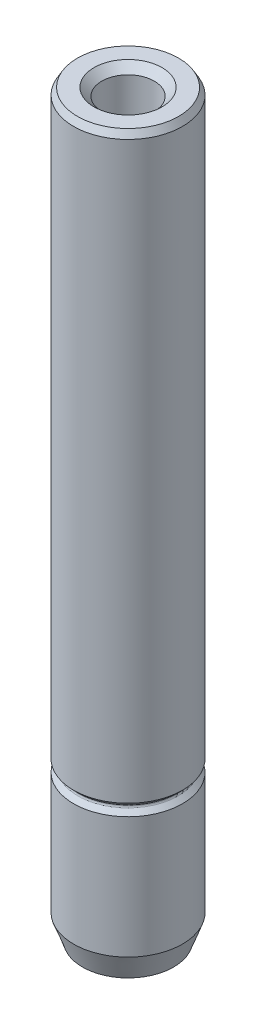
ISO-10303-21;
HEADER;
FILE_DESCRIPTION(('STEP AP214'),'2;1');
FILE_NAME('part.step','',(''),(''),'','','');
FILE_SCHEMA(('AUTOMOTIVE_DESIGN { 1 0 10303 214 1 1 1 1 }'));
ENDSEC;
DATA;
#1=APPLICATION_CONTEXT('core data for automotive mechanical design processes');
#2=APPLICATION_PROTOCOL_DEFINITION('international standard','automotive_design',2000,#1);
#3=PRODUCT_CONTEXT('',#1,'mechanical');
#4=PRODUCT('Part','Part','',(#3));
#5=PRODUCT_RELATED_PRODUCT_CATEGORY('part','',(#4));
#6=PRODUCT_DEFINITION_FORMATION('','',#4);
#7=PRODUCT_DEFINITION_CONTEXT('part definition',#1,'design');
#8=PRODUCT_DEFINITION('design','',#6,#7);
#9=PRODUCT_DEFINITION_SHAPE('','',#8);
#10=(LENGTH_UNIT() NAMED_UNIT(*) SI_UNIT(.MILLI.,.METRE.));
#11=(NAMED_UNIT(*) PLANE_ANGLE_UNIT() SI_UNIT($,.RADIAN.));
#12=(NAMED_UNIT(*) SI_UNIT($,.STERADIAN.) SOLID_ANGLE_UNIT());
#13=UNCERTAINTY_MEASURE_WITH_UNIT(LENGTH_MEASURE(1.E-05),#10,'distance_accuracy_value','');
#14=(GEOMETRIC_REPRESENTATION_CONTEXT(3) GLOBAL_UNCERTAINTY_ASSIGNED_CONTEXT((#13)) GLOBAL_UNIT_ASSIGNED_CONTEXT((#10,
#11,#12)) REPRESENTATION_CONTEXT('',''));
#15=CARTESIAN_POINT('',(0.,0.,0.));
#16=DIRECTION('',(0.,0.,1.));
#17=DIRECTION('',(1.,0.,0.));
#18=AXIS2_PLACEMENT_3D('',#15,#16,#17);
#19=CARTESIAN_POINT('',(-2.9781972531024,0.,0.));
#20=DIRECTION('',(0.,1.,0.));
#21=DIRECTION('',(0.,0.,1.));
#22=AXIS2_PLACEMENT_3D('',#19,#20,#21);
#23=PLANE('',#22);
#24=CARTESIAN_POINT('',(0.,0.,0.));
#25=DIRECTION('',(0.,-1.,0.));
#26=DIRECTION('',(0.,0.,-1.));
#27=AXIS2_PLACEMENT_3D('',#24,#25,#26);
#28=CIRCLE('',#27,2.159);
#29=CARTESIAN_POINT('',(0.,0.,-2.159));
#30=VERTEX_POINT('',#29);
#31=EDGE_CURVE('E66',#30,#30,#28,.T.);
#32=ORIENTED_EDGE('',*,*,#31,.F.);
#33=EDGE_LOOP('',(#32));
#34=FACE_BOUND('',#33,.T.);
#35=CARTESIAN_POINT('',(0.,0.,0.));
#36=DIRECTION('',(0.,-1.,0.));
#37=DIRECTION('',(0.,0.,-1.));
#38=AXIS2_PLACEMENT_3D('',#35,#36,#37);
#39=CIRCLE('',#38,2.9781972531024);
#40=CARTESIAN_POINT('',(0.,0.,-2.9781972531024));
#41=VERTEX_POINT('',#40);
#42=EDGE_CURVE('E84',#41,#41,#39,.T.);
#43=ORIENTED_EDGE('',*,*,#42,.T.);
#44=EDGE_LOOP('',(#43));
#45=FACE_BOUND('',#44,.T.);
#46=ADVANCED_FACE('F36',(#34,#45),#23,.F.);
#47=CARTESIAN_POINT('',(0.,0.,0.));
#48=DIRECTION('',(0.,-1.,0.));
#49=DIRECTION('',(0.,0.,-1.));
#50=AXIS2_PLACEMENT_3D('',#47,#48,#49);
#51=CYLINDRICAL_SURFACE('',#50,2.159);
#52=CARTESIAN_POINT('',(0.,1.6002,0.));
#53=DIRECTION('',(0.,-1.,0.));
#54=DIRECTION('',(0.,0.,-1.));
#55=AXIS2_PLACEMENT_3D('',#52,#53,#54);
#56=CIRCLE('',#55,2.159);
#57=CARTESIAN_POINT('',(0.,1.6002,-2.159));
#58=VERTEX_POINT('',#57);
#59=EDGE_CURVE('E69',#58,#58,#56,.T.);
#60=ORIENTED_EDGE('',*,*,#59,.F.);
#61=EDGE_LOOP('',(#60));
#62=FACE_BOUND('',#61,.T.);
#63=ORIENTED_EDGE('',*,*,#31,.T.);
#64=EDGE_LOOP('',(#63));
#65=FACE_BOUND('',#64,.T.);
#66=ADVANCED_FACE('F112',(#62,#65),#51,.F.);
#67=CARTESIAN_POINT('',(-2.159,1.6002,0.));
#68=DIRECTION('',(0.,1.,0.));
#69=DIRECTION('',(0.,0.,1.));
#70=AXIS2_PLACEMENT_3D('',#67,#68,#69);
#71=PLANE('',#70);
#72=CARTESIAN_POINT('',(0.,1.6002,0.));
#73=DIRECTION('',(0.,-1.,0.));
#74=DIRECTION('',(0.,0.,-1.));
#75=AXIS2_PLACEMENT_3D('',#72,#73,#74);
#76=CIRCLE('',#75,1.7145);
#77=CARTESIAN_POINT('',(0.,1.6002,-1.7145));
#78=VERTEX_POINT('',#77);
#79=EDGE_CURVE('E72',#78,#78,#76,.T.);
#80=ORIENTED_EDGE('',*,*,#79,.F.);
#81=EDGE_LOOP('',(#80));
#82=FACE_BOUND('',#81,.T.);
#83=ORIENTED_EDGE('',*,*,#59,.T.);
#84=EDGE_LOOP('',(#83));
#85=FACE_BOUND('',#84,.T.);
#86=ADVANCED_FACE('F118',(#82,#85),#71,.F.);
#87=CARTESIAN_POINT('',(0.,0.,0.));
#88=DIRECTION('',(0.,-1.,0.));
#89=DIRECTION('',(0.,0.,-1.));
#90=AXIS2_PLACEMENT_3D('',#87,#88,#89);
#91=CYLINDRICAL_SURFACE('',#90,1.7145);
#92=CARTESIAN_POINT('',(0.,47.752,0.));
#93=DIRECTION('',(0.,-1.,0.));
#94=DIRECTION('',(0.,0.,-1.));
#95=AXIS2_PLACEMENT_3D('',#92,#93,#94);
#96=CIRCLE('',#95,1.7145);
#97=CARTESIAN_POINT('',(0.,47.752,-1.7145));
#98=VERTEX_POINT('',#97);
#99=EDGE_CURVE('E47',#98,#98,#96,.F.);
#100=ORIENTED_EDGE('',*,*,#99,.T.);
#101=EDGE_LOOP('',(#100));
#102=FACE_BOUND('',#101,.T.);
#103=ORIENTED_EDGE('',*,*,#79,.T.);
#104=EDGE_LOOP('',(#103));
#105=FACE_BOUND('',#104,.T.);
#106=ADVANCED_FACE('F140',(#102,#105),#91,.F.);
#107=CARTESIAN_POINT('',(-1.7145,48.26,0.));
#108=DIRECTION('',(0.,-1.,0.));
#109=DIRECTION('',(0.,0.,-1.));
#110=AXIS2_PLACEMENT_3D('',#107,#108,#109);
#111=PLANE('',#110);
#112=CARTESIAN_POINT('',(0.,48.26,0.));
#113=DIRECTION('',(0.,-1.,0.));
#114=DIRECTION('',(0.,0.,-1.));
#115=AXIS2_PLACEMENT_3D('',#112,#113,#114);
#116=CIRCLE('',#115,2.2225);
#117=CARTESIAN_POINT('',(0.,48.26,-2.2225));
#118=VERTEX_POINT('',#117);
#119=EDGE_CURVE('E52',#118,#118,#116,.T.);
#120=ORIENTED_EDGE('',*,*,#119,.T.);
#121=EDGE_LOOP('',(#120));
#122=FACE_BOUND('',#121,.T.);
#123=CARTESIAN_POINT('',(0.,48.26,0.));
#124=DIRECTION('',(0.,-1.,0.));
#125=DIRECTION('',(0.,0.,-1.));
#126=AXIS2_PLACEMENT_3D('',#123,#124,#125);
#127=CIRCLE('',#126,3.30200000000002);
#128=CARTESIAN_POINT('',(0.,48.26,-3.30200000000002));
#129=VERTEX_POINT('',#128);
#130=EDGE_CURVE('E58',#129,#129,#127,.F.);
#131=ORIENTED_EDGE('',*,*,#130,.T.);
#132=EDGE_LOOP('',(#131));
#133=FACE_BOUND('',#132,.T.);
#134=ADVANCED_FACE('F137',(#122,#133),#111,.F.);
#135=CARTESIAN_POINT('',(0.,0.,0.));
#136=DIRECTION('',(0.,-1.,0.));
#137=DIRECTION('',(0.,0.,-1.));
#138=AXIS2_PLACEMENT_3D('',#135,#136,#137);
#139=CYLINDRICAL_SURFACE('',#138,3.556);
#140=CARTESIAN_POINT('',(0.,47.8200590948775,0.));
#141=DIRECTION('',(0.,-1.,0.));
#142=DIRECTION('',(0.,0.,-1.));
#143=AXIS2_PLACEMENT_3D('',#140,#141,#142);
#144=CIRCLE('',#143,3.556);
#145=CARTESIAN_POINT('',(0.,47.8200590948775,-3.556));
#146=VERTEX_POINT('',#145);
#147=EDGE_CURVE('E62',#146,#146,#144,.T.);
#148=ORIENTED_EDGE('',*,*,#147,.T.);
#149=EDGE_LOOP('',(#148));
#150=FACE_BOUND('',#149,.T.);
#151=CARTESIAN_POINT('',(0.,10.287,0.));
#152=DIRECTION('',(0.,-1.,0.));
#153=DIRECTION('',(0.,0.,-1.));
#154=AXIS2_PLACEMENT_3D('',#151,#152,#153);
#155=CIRCLE('',#154,3.556);
#156=CARTESIAN_POINT('',(0.,10.287,-3.556));
#157=VERTEX_POINT('',#156);
#158=EDGE_CURVE('E75',#157,#157,#155,.T.);
#159=ORIENTED_EDGE('',*,*,#158,.F.);
#160=EDGE_LOOP('',(#159));
#161=FACE_BOUND('',#160,.T.);
#162=ADVANCED_FACE('F109',(#150,#161),#139,.T.);
#163=CARTESIAN_POINT('',(0.,10.287,0.));
#164=DIRECTION('',(0.,1.,0.));
#165=DIRECTION('',(0.,0.,1.));
#166=AXIS2_PLACEMENT_3D('',#163,#164,#165);
#167=CONICAL_SURFACE('',#166,3.556,0.785398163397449);
#168=CARTESIAN_POINT('',(0.,9.99580256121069,0.));
#169=DIRECTION('',(0.,1.,0.));
#170=DIRECTION('',(0.,0.,1.));
#171=AXIS2_PLACEMENT_3D('',#168,#169,#170);
#172=CIRCLE('',#171,3.26480256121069);
#173=CARTESIAN_POINT('',(0.,9.99580256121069,3.26480256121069));
#174=VERTEX_POINT('',#173);
#175=EDGE_CURVE('E10',#174,#174,#172,.T.);
#176=ORIENTED_EDGE('',*,*,#175,.T.);
#177=EDGE_LOOP('',(#176));
#178=FACE_BOUND('',#177,.T.);
#179=ORIENTED_EDGE('',*,*,#158,.T.);
#180=EDGE_LOOP('',(#179));
#181=FACE_BOUND('',#180,.T.);
#182=ADVANCED_FACE('F104',(#178,#181),#167,.T.);
#183=CARTESIAN_POINT('',(0.,9.906,0.));
#184=DIRECTION('',(0.,-1.,0.));
#185=DIRECTION('',(0.,0.,-1.));
#186=AXIS2_PLACEMENT_3D('',#183,#184,#185);
#187=CONICAL_SURFACE('',#186,3.175,0.785398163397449);
#188=CARTESIAN_POINT('',(0.,9.81619743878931,0.));
#189=DIRECTION('',(0.,-1.,0.));
#190=DIRECTION('',(0.,0.,-1.));
#191=AXIS2_PLACEMENT_3D('',#188,#189,#190);
#192=CIRCLE('',#191,3.26480256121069);
#193=CARTESIAN_POINT('',(0.,9.81619743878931,-3.26480256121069));
#194=VERTEX_POINT('',#193);
#195=EDGE_CURVE('E43',#194,#194,#192,.T.);
#196=ORIENTED_EDGE('',*,*,#195,.T.);
#197=EDGE_LOOP('',(#196));
#198=FACE_BOUND('',#197,.T.);
#199=CARTESIAN_POINT('',(0.,9.525,0.));
#200=DIRECTION('',(0.,-1.,0.));
#201=DIRECTION('',(0.,0.,-1.));
#202=AXIS2_PLACEMENT_3D('',#199,#200,#201);
#203=CIRCLE('',#202,3.556);
#204=CARTESIAN_POINT('',(0.,9.525,-3.556));
#205=VERTEX_POINT('',#204);
#206=EDGE_CURVE('E78',#205,#205,#203,.T.);
#207=ORIENTED_EDGE('',*,*,#206,.F.);
#208=EDGE_LOOP('',(#207));
#209=FACE_BOUND('',#208,.T.);
#210=ADVANCED_FACE('F99',(#198,#209),#187,.T.);
#211=CARTESIAN_POINT('',(0.,0.,0.));
#212=DIRECTION('',(0.,-1.,0.));
#213=DIRECTION('',(0.,0.,-1.));
#214=AXIS2_PLACEMENT_3D('',#211,#212,#213);
#215=CYLINDRICAL_SURFACE('',#214,3.55599999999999);
#216=CARTESIAN_POINT('',(0.,1.5875,0.));
#217=DIRECTION('',(0.,-1.,0.));
#218=DIRECTION('',(0.,0.,-1.));
#219=AXIS2_PLACEMENT_3D('',#216,#217,#218);
#220=CIRCLE('',#219,3.55599999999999);
#221=CARTESIAN_POINT('',(0.,1.5875,-3.55599999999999));
#222=VERTEX_POINT('',#221);
#223=EDGE_CURVE('E81',#222,#222,#220,.T.);
#224=ORIENTED_EDGE('',*,*,#223,.F.);
#225=EDGE_LOOP('',(#224));
#226=FACE_BOUND('',#225,.T.);
#227=ORIENTED_EDGE('',*,*,#206,.T.);
#228=EDGE_LOOP('',(#227));
#229=FACE_BOUND('',#228,.T.);
#230=ADVANCED_FACE('F93',(#226,#229),#215,.T.);
#231=CARTESIAN_POINT('',(0.,1.5875,0.));
#232=DIRECTION('',(0.,1.,0.));
#233=DIRECTION('',(0.,0.,1.));
#234=AXIS2_PLACEMENT_3D('',#231,#232,#233);
#235=CONICAL_SURFACE('',#234,3.55599999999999,0.349065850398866);
#236=ORIENTED_EDGE('',*,*,#42,.F.);
#237=EDGE_LOOP('',(#236));
#238=FACE_BOUND('',#237,.T.);
#239=ORIENTED_EDGE('',*,*,#223,.T.);
#240=EDGE_LOOP('',(#239));
#241=FACE_BOUND('',#240,.T.);
#242=ADVANCED_FACE('F89',(#238,#241),#235,.T.);
#243=CARTESIAN_POINT('',(0.,47.8200590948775,0.));
#244=DIRECTION('',(0.,-1.,0.));
#245=DIRECTION('',(0.,0.,-1.));
#246=AXIS2_PLACEMENT_3D('',#243,#244,#245);
#247=CONICAL_SURFACE('',#246,3.556,0.523598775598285);
#248=ORIENTED_EDGE('',*,*,#130,.F.);
#249=EDGE_LOOP('',(#248));
#250=FACE_BOUND('',#249,.T.);
#251=ORIENTED_EDGE('',*,*,#147,.F.);
#252=EDGE_LOOP('',(#251));
#253=FACE_BOUND('',#252,.T.);
#254=ADVANCED_FACE('F92',(#250,#253),#247,.T.);
#255=CARTESIAN_POINT('',(0.,48.26,0.));
#256=DIRECTION('',(0.,1.,0.));
#257=DIRECTION('',(0.,0.,1.));
#258=AXIS2_PLACEMENT_3D('',#255,#256,#257);
#259=CONICAL_SURFACE('',#258,2.2225,0.785398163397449);
#260=ORIENTED_EDGE('',*,*,#99,.F.);
#261=EDGE_LOOP('',(#260));
#262=FACE_BOUND('',#261,.T.);
#263=ORIENTED_EDGE('',*,*,#119,.F.);
#264=EDGE_LOOP('',(#263));
#265=FACE_BOUND('',#264,.T.);
#266=ADVANCED_FACE('F125',(#262,#265),#259,.F.);
#267=CARTESIAN_POINT('',(0.,9.906,0.));
#268=DIRECTION('',(0.,-1.,0.));
#269=DIRECTION('',(0.,0.,-1.));
#270=AXIS2_PLACEMENT_3D('',#267,#268,#269);
#271=TOROIDAL_SURFACE('',#270,3.35460512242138,0.127);
#272=ORIENTED_EDGE('',*,*,#175,.F.);
#273=EDGE_LOOP('',(#272));
#274=FACE_BOUND('',#273,.T.);
#275=ORIENTED_EDGE('',*,*,#195,.F.);
#276=EDGE_LOOP('',(#275));
#277=FACE_BOUND('',#276,.T.);
#278=ADVANCED_FACE('F38',(#274,#277),#271,.F.);
#279=CLOSED_SHELL('',(#46,#66,#86,#106,#134,#162,#182,#210,#230,#242,#254,#266,#278));
#280=MANIFOLD_SOLID_BREP('B2',#279);
#281=ADVANCED_BREP_SHAPE_REPRESENTATION('',(#18,#280),#14);
#282=SHAPE_DEFINITION_REPRESENTATION(#9,#281);
ENDSEC;
END-ISO-10303-21;
